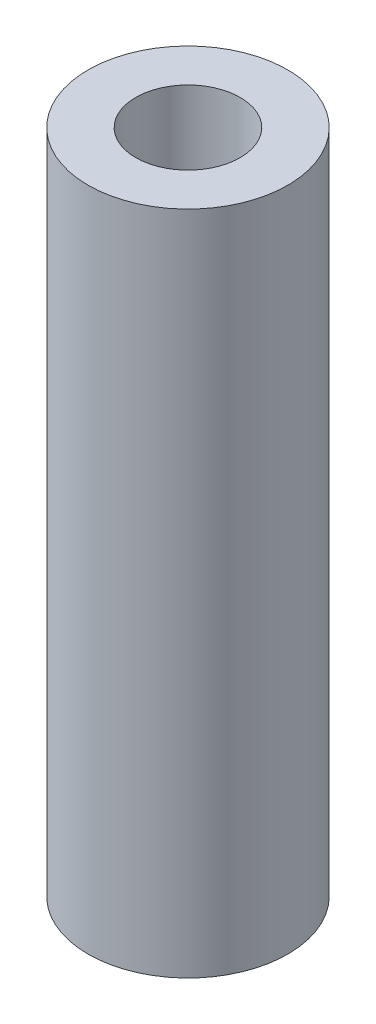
ISO-10303-21;
HEADER;
FILE_DESCRIPTION(('STEP AP214'),'2;1');
FILE_NAME('part.step','',(''),(''),'','','');
FILE_SCHEMA(('AUTOMOTIVE_DESIGN { 1 0 10303 214 1 1 1 1 }'));
ENDSEC;
DATA;
#1=APPLICATION_CONTEXT('core data for automotive mechanical design processes');
#2=APPLICATION_PROTOCOL_DEFINITION('international standard','automotive_design',2000,#1);
#3=PRODUCT_CONTEXT('',#1,'mechanical');
#4=PRODUCT('Part','Part','',(#3));
#5=PRODUCT_RELATED_PRODUCT_CATEGORY('part','',(#4));
#6=PRODUCT_DEFINITION_FORMATION('','',#4);
#7=PRODUCT_DEFINITION_CONTEXT('part definition',#1,'design');
#8=PRODUCT_DEFINITION('design','',#6,#7);
#9=PRODUCT_DEFINITION_SHAPE('','',#8);
#10=(LENGTH_UNIT() NAMED_UNIT(*) SI_UNIT(.MILLI.,.METRE.));
#11=(NAMED_UNIT(*) PLANE_ANGLE_UNIT() SI_UNIT($,.RADIAN.));
#12=(NAMED_UNIT(*) SI_UNIT($,.STERADIAN.) SOLID_ANGLE_UNIT());
#13=UNCERTAINTY_MEASURE_WITH_UNIT(LENGTH_MEASURE(1.E-05),#10,'distance_accuracy_value','');
#14=(GEOMETRIC_REPRESENTATION_CONTEXT(3) GLOBAL_UNCERTAINTY_ASSIGNED_CONTEXT((#13)) GLOBAL_UNIT_ASSIGNED_CONTEXT((#10,
#11,#12)) REPRESENTATION_CONTEXT('',''));
#15=CARTESIAN_POINT('',(0.,0.,0.));
#16=DIRECTION('',(0.,0.,1.));
#17=DIRECTION('',(1.,0.,0.));
#18=AXIS2_PLACEMENT_3D('',#15,#16,#17);
#19=CARTESIAN_POINT('',(0.,31.75,0.));
#20=DIRECTION('',(0.,1.,0.));
#21=DIRECTION('',(0.,0.,1.));
#22=AXIS2_PLACEMENT_3D('',#19,#20,#21);
#23=PLANE('',#22);
#24=CARTESIAN_POINT('',(0.,31.75,0.));
#25=DIRECTION('',(0.,1.,0.));
#26=DIRECTION('',(0.,0.,1.));
#27=AXIS2_PLACEMENT_3D('',#24,#25,#26);
#28=CIRCLE('',#27,4.7625);
#29=CARTESIAN_POINT('',(0.,31.75,4.7625));
#30=VERTEX_POINT('',#29);
#31=EDGE_CURVE('E10',#30,#30,#28,.T.);
#32=ORIENTED_EDGE('',*,*,#31,.T.);
#33=EDGE_LOOP('',(#32));
#34=FACE_BOUND('',#33,.T.);
#35=CARTESIAN_POINT('',(0.,31.75,0.));
#36=DIRECTION('',(0.,1.,0.));
#37=DIRECTION('',(0.,0.,1.));
#38=AXIS2_PLACEMENT_3D('',#35,#36,#37);
#39=CIRCLE('',#38,2.4892);
#40=CARTESIAN_POINT('',(0.,31.75,2.4892));
#41=VERTEX_POINT('',#40);
#42=EDGE_CURVE('E47',#41,#41,#39,.T.);
#43=ORIENTED_EDGE('',*,*,#42,.F.);
#44=EDGE_LOOP('',(#43));
#45=FACE_BOUND('',#44,.T.);
#46=ADVANCED_FACE('F36',(#34,#45),#23,.T.);
#47=CARTESIAN_POINT('',(0.,0.,0.));
#48=DIRECTION('',(0.,1.,0.));
#49=DIRECTION('',(0.,0.,1.));
#50=AXIS2_PLACEMENT_3D('',#47,#48,#49);
#51=PLANE('',#50);
#52=CARTESIAN_POINT('',(0.,0.,0.));
#53=DIRECTION('',(0.,1.,0.));
#54=DIRECTION('',(0.,0.,1.));
#55=AXIS2_PLACEMENT_3D('',#52,#53,#54);
#56=CIRCLE('',#55,4.7625);
#57=CARTESIAN_POINT('',(0.,0.,4.7625));
#58=VERTEX_POINT('',#57);
#59=EDGE_CURVE('E40',#58,#58,#56,.T.);
#60=ORIENTED_EDGE('',*,*,#59,.F.);
#61=EDGE_LOOP('',(#60));
#62=FACE_BOUND('',#61,.T.);
#63=CARTESIAN_POINT('',(0.,0.,0.));
#64=DIRECTION('',(0.,1.,0.));
#65=DIRECTION('',(0.,0.,1.));
#66=AXIS2_PLACEMENT_3D('',#63,#64,#65);
#67=CIRCLE('',#66,2.4892);
#68=CARTESIAN_POINT('',(0.,0.,2.4892));
#69=VERTEX_POINT('',#68);
#70=EDGE_CURVE('E49',#69,#69,#67,.T.);
#71=ORIENTED_EDGE('',*,*,#70,.T.);
#72=EDGE_LOOP('',(#71));
#73=FACE_BOUND('',#72,.T.);
#74=ADVANCED_FACE('F59',(#62,#73),#51,.F.);
#75=CARTESIAN_POINT('',(0.,31.75,0.));
#76=DIRECTION('',(0.,-1.,0.));
#77=DIRECTION('',(0.,0.,-1.));
#78=AXIS2_PLACEMENT_3D('',#75,#76,#77);
#79=CYLINDRICAL_SURFACE('',#78,4.7625);
#80=ORIENTED_EDGE('',*,*,#31,.F.);
#81=EDGE_LOOP('',(#80));
#82=FACE_BOUND('',#81,.T.);
#83=ORIENTED_EDGE('',*,*,#59,.T.);
#84=EDGE_LOOP('',(#83));
#85=FACE_BOUND('',#84,.T.);
#86=ADVANCED_FACE('F38',(#82,#85),#79,.T.);
#87=CARTESIAN_POINT('',(0.,31.75,0.));
#88=DIRECTION('',(0.,-1.,0.));
#89=DIRECTION('',(0.,0.,-1.));
#90=AXIS2_PLACEMENT_3D('',#87,#88,#89);
#91=CYLINDRICAL_SURFACE('',#90,2.4892);
#92=ORIENTED_EDGE('',*,*,#42,.T.);
#93=EDGE_LOOP('',(#92));
#94=FACE_BOUND('',#93,.T.);
#95=ORIENTED_EDGE('',*,*,#70,.F.);
#96=EDGE_LOOP('',(#95));
#97=FACE_BOUND('',#96,.T.);
#98=ADVANCED_FACE('F55',(#94,#97),#91,.F.);
#99=CLOSED_SHELL('',(#46,#74,#86,#98));
#100=MANIFOLD_SOLID_BREP('B2',#99);
#101=ADVANCED_BREP_SHAPE_REPRESENTATION('',(#18,#100),#14);
#102=SHAPE_DEFINITION_REPRESENTATION(#9,#101);
ENDSEC;
END-ISO-10303-21;
